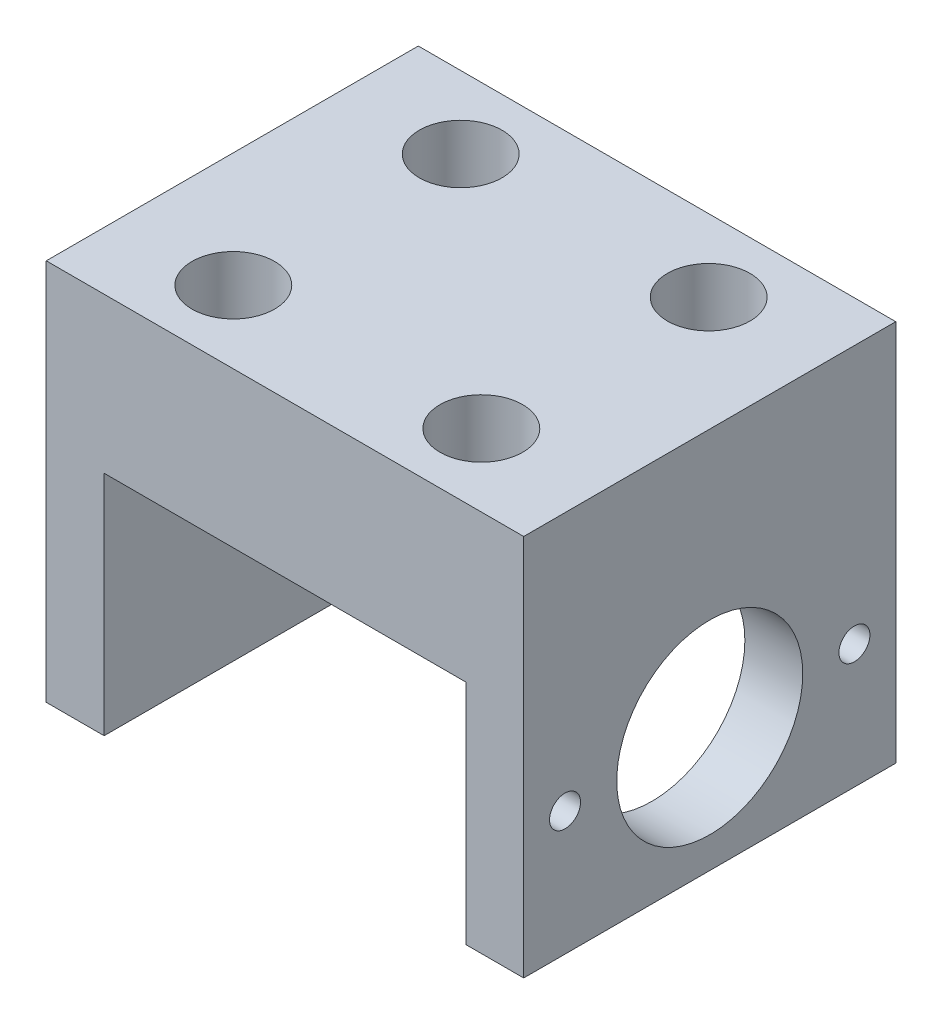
ISO-10303-21;
HEADER;
FILE_DESCRIPTION(('STEP AP214'),'2;1');
FILE_NAME('part.step','',(''),(''),'','','');
FILE_SCHEMA(('AUTOMOTIVE_DESIGN { 1 0 10303 214 1 1 1 1 }'));
ENDSEC;
DATA;
#1=APPLICATION_CONTEXT('core data for automotive mechanical design processes');
#2=APPLICATION_PROTOCOL_DEFINITION('international standard','automotive_design',2000,#1);
#3=PRODUCT_CONTEXT('',#1,'mechanical');
#4=PRODUCT('Part','Part','',(#3));
#5=PRODUCT_RELATED_PRODUCT_CATEGORY('part','',(#4));
#6=PRODUCT_DEFINITION_FORMATION('','',#4);
#7=PRODUCT_DEFINITION_CONTEXT('part definition',#1,'design');
#8=PRODUCT_DEFINITION('design','',#6,#7);
#9=PRODUCT_DEFINITION_SHAPE('','',#8);
#10=(LENGTH_UNIT() NAMED_UNIT(*) SI_UNIT(.MILLI.,.METRE.));
#11=(NAMED_UNIT(*) PLANE_ANGLE_UNIT() SI_UNIT($,.RADIAN.));
#12=(NAMED_UNIT(*) SI_UNIT($,.STERADIAN.) SOLID_ANGLE_UNIT());
#13=UNCERTAINTY_MEASURE_WITH_UNIT(LENGTH_MEASURE(1.E-05),#10,'distance_accuracy_value','');
#14=(GEOMETRIC_REPRESENTATION_CONTEXT(3) GLOBAL_UNCERTAINTY_ASSIGNED_CONTEXT((#13)) GLOBAL_UNIT_ASSIGNED_CONTEXT((#10,
#11,#12)) REPRESENTATION_CONTEXT('',''));
#15=CARTESIAN_POINT('',(0.,0.,0.));
#16=DIRECTION('',(0.,0.,1.));
#17=DIRECTION('',(1.,0.,0.));
#18=AXIS2_PLACEMENT_3D('',#15,#16,#17);
#19=CARTESIAN_POINT('',(-23.1,-37.,-18.));
#20=DIRECTION('',(0.,-1.,0.));
#21=DIRECTION('',(0.,0.,-1.));
#22=AXIS2_PLACEMENT_3D('',#19,#20,#21);
#23=PLANE('',#22);
#24=DIRECTION('',(0.,0.,-1.));
#25=VECTOR('',#24,1.);
#26=CARTESIAN_POINT('',(17.5,-37.,18.));
#27=LINE('',#26,#25);
#28=CARTESIAN_POINT('',(17.5,-37.,18.));
#29=VERTEX_POINT('',#28);
#30=CARTESIAN_POINT('',(17.5,-37.,-18.));
#31=VERTEX_POINT('',#30);
#32=EDGE_CURVE('E90',#29,#31,#27,.T.);
#33=ORIENTED_EDGE('',*,*,#32,.T.);
#34=DIRECTION('',(1.,0.,0.));
#35=VECTOR('',#34,1.);
#36=CARTESIAN_POINT('',(-23.1,-37.,-18.));
#37=LINE('',#36,#35);
#38=CARTESIAN_POINT('',(23.1,-37.,-18.));
#39=VERTEX_POINT('',#38);
#40=EDGE_CURVE('E181',#31,#39,#37,.T.);
#41=ORIENTED_EDGE('',*,*,#40,.T.);
#42=DIRECTION('',(0.,0.,1.));
#43=VECTOR('',#42,1.);
#44=CARTESIAN_POINT('',(23.1,-37.,-18.));
#45=LINE('',#44,#43);
#46=CARTESIAN_POINT('',(23.1,-37.,18.));
#47=VERTEX_POINT('',#46);
#48=EDGE_CURVE('E25',#39,#47,#45,.T.);
#49=ORIENTED_EDGE('',*,*,#48,.T.);
#50=DIRECTION('',(1.,0.,0.));
#51=VECTOR('',#50,1.);
#52=CARTESIAN_POINT('',(-23.1,-37.,18.));
#53=LINE('',#52,#51);
#54=EDGE_CURVE('E104',#29,#47,#53,.T.);
#55=ORIENTED_EDGE('',*,*,#54,.F.);
#56=EDGE_LOOP('',(#33,#41,#49,#55));
#57=FACE_BOUND('',#56,.T.);
#58=ADVANCED_FACE('F16',(#57),#23,.T.);
#59=CARTESIAN_POINT('',(23.1,0.,-18.));
#60=DIRECTION('',(0.,1.,0.));
#61=DIRECTION('',(-1.,0.,0.));
#62=AXIS2_PLACEMENT_3D('',#59,#60,#61);
#63=PLANE('',#62);
#64=CARTESIAN_POINT('',(12.,0.,11.));
#65=DIRECTION('',(0.,1.,0.));
#66=DIRECTION('',(0.,0.,1.));
#67=AXIS2_PLACEMENT_3D('',#64,#65,#66);
#68=CIRCLE('',#67,4.);
#69=CARTESIAN_POINT('',(12.,0.,15.));
#70=VERTEX_POINT('',#69);
#71=EDGE_CURVE('E148',#70,#70,#68,.T.);
#72=ORIENTED_EDGE('',*,*,#71,.F.);
#73=EDGE_LOOP('',(#72));
#74=FACE_BOUND('',#73,.T.);
#75=CARTESIAN_POINT('',(-12.,0.,11.));
#76=DIRECTION('',(0.,1.,0.));
#77=DIRECTION('',(0.,0.,1.));
#78=AXIS2_PLACEMENT_3D('',#75,#76,#77);
#79=CIRCLE('',#78,4.);
#80=CARTESIAN_POINT('',(-12.,0.,15.));
#81=VERTEX_POINT('',#80);
#82=EDGE_CURVE('E138',#81,#81,#79,.T.);
#83=ORIENTED_EDGE('',*,*,#82,.F.);
#84=EDGE_LOOP('',(#83));
#85=FACE_BOUND('',#84,.T.);
#86=CARTESIAN_POINT('',(-12.,0.,-11.));
#87=DIRECTION('',(0.,1.,0.));
#88=DIRECTION('',(0.,0.,1.));
#89=AXIS2_PLACEMENT_3D('',#86,#87,#88);
#90=CIRCLE('',#89,4.);
#91=CARTESIAN_POINT('',(-12.,0.,-7.));
#92=VERTEX_POINT('',#91);
#93=EDGE_CURVE('E135',#92,#92,#90,.T.);
#94=ORIENTED_EDGE('',*,*,#93,.F.);
#95=EDGE_LOOP('',(#94));
#96=FACE_BOUND('',#95,.T.);
#97=CARTESIAN_POINT('',(12.,0.,-11.));
#98=DIRECTION('',(0.,1.,0.));
#99=DIRECTION('',(0.,0.,1.));
#100=AXIS2_PLACEMENT_3D('',#97,#98,#99);
#101=CIRCLE('',#100,4.);
#102=CARTESIAN_POINT('',(12.,0.,-7.));
#103=VERTEX_POINT('',#102);
#104=EDGE_CURVE('E132',#103,#103,#101,.T.);
#105=ORIENTED_EDGE('',*,*,#104,.F.);
#106=EDGE_LOOP('',(#105));
#107=FACE_BOUND('',#106,.T.);
#108=DIRECTION('',(-1.,0.,0.));
#109=VECTOR('',#108,1.);
#110=CARTESIAN_POINT('',(23.1,0.,18.));
#111=LINE('',#110,#109);
#112=CARTESIAN_POINT('',(23.1,0.,18.));
#113=VERTEX_POINT('',#112);
#114=CARTESIAN_POINT('',(-23.1,0.,18.));
#115=VERTEX_POINT('',#114);
#116=EDGE_CURVE('E117',#113,#115,#111,.T.);
#117=ORIENTED_EDGE('',*,*,#116,.F.);
#118=DIRECTION('',(0.,0.,1.));
#119=VECTOR('',#118,1.);
#120=CARTESIAN_POINT('',(23.1,0.,-18.));
#121=LINE('',#120,#119);
#122=CARTESIAN_POINT('',(23.1,0.,-18.));
#123=VERTEX_POINT('',#122);
#124=EDGE_CURVE('E10',#123,#113,#121,.T.);
#125=ORIENTED_EDGE('',*,*,#124,.F.);
#126=DIRECTION('',(-1.,0.,0.));
#127=VECTOR('',#126,1.);
#128=CARTESIAN_POINT('',(23.1,0.,-18.));
#129=LINE('',#128,#127);
#130=CARTESIAN_POINT('',(-23.1,0.,-18.));
#131=VERTEX_POINT('',#130);
#132=EDGE_CURVE('E121',#123,#131,#129,.T.);
#133=ORIENTED_EDGE('',*,*,#132,.T.);
#134=DIRECTION('',(0.,0.,1.));
#135=VECTOR('',#134,1.);
#136=CARTESIAN_POINT('',(-23.1,0.,-18.));
#137=LINE('',#136,#135);
#138=EDGE_CURVE('E66',#131,#115,#137,.T.);
#139=ORIENTED_EDGE('',*,*,#138,.T.);
#140=EDGE_LOOP('',(#117,#125,#133,#139));
#141=FACE_BOUND('',#140,.T.);
#142=ADVANCED_FACE('F18',(#74,#85,#96,#107,#141),#63,.T.);
#143=CARTESIAN_POINT('',(23.1,-37.,-18.));
#144=DIRECTION('',(1.,0.,0.));
#145=DIRECTION('',(0.,1.,0.));
#146=AXIS2_PLACEMENT_3D('',#143,#144,#145);
#147=PLANE('',#146);
#148=CARTESIAN_POINT('',(23.1,-25.,0.));
#149=DIRECTION('',(1.,0.,0.));
#150=DIRECTION('',(0.,0.,-1.));
#151=AXIS2_PLACEMENT_3D('',#148,#149,#150);
#152=CIRCLE('',#151,9.);
#153=CARTESIAN_POINT('',(23.1,-25.,-9.));
#154=VERTEX_POINT('',#153);
#155=EDGE_CURVE('E272',#154,#154,#152,.T.);
#156=ORIENTED_EDGE('',*,*,#155,.F.);
#157=EDGE_LOOP('',(#156));
#158=FACE_BOUND('',#157,.T.);
#159=CARTESIAN_POINT('',(23.1,-25.,14.));
#160=DIRECTION('',(1.,0.,0.));
#161=DIRECTION('',(0.,0.,-1.));
#162=AXIS2_PLACEMENT_3D('',#159,#160,#161);
#163=CIRCLE('',#162,1.49999999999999);
#164=CARTESIAN_POINT('',(23.1,-25.,12.5));
#165=VERTEX_POINT('',#164);
#166=EDGE_CURVE('E131',#165,#165,#163,.T.);
#167=ORIENTED_EDGE('',*,*,#166,.F.);
#168=EDGE_LOOP('',(#167));
#169=FACE_BOUND('',#168,.T.);
#170=CARTESIAN_POINT('',(23.1,-25.,-14.));
#171=DIRECTION('',(1.,0.,0.));
#172=DIRECTION('',(0.,0.,-1.));
#173=AXIS2_PLACEMENT_3D('',#170,#171,#172);
#174=CIRCLE('',#173,1.49999999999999);
#175=CARTESIAN_POINT('',(23.1,-25.,-15.5));
#176=VERTEX_POINT('',#175);
#177=EDGE_CURVE('E159',#176,#176,#174,.T.);
#178=ORIENTED_EDGE('',*,*,#177,.F.);
#179=EDGE_LOOP('',(#178));
#180=FACE_BOUND('',#179,.T.);
#181=DIRECTION('',(0.,1.,0.));
#182=VECTOR('',#181,1.);
#183=CARTESIAN_POINT('',(23.1,-37.,18.));
#184=LINE('',#183,#182);
#185=EDGE_CURVE('E115',#47,#113,#184,.T.);
#186=ORIENTED_EDGE('',*,*,#185,.F.);
#187=ORIENTED_EDGE('',*,*,#48,.F.);
#188=DIRECTION('',(0.,1.,0.));
#189=VECTOR('',#188,1.);
#190=CARTESIAN_POINT('',(23.1,-37.,-18.));
#191=LINE('',#190,#189);
#192=EDGE_CURVE('E127',#39,#123,#191,.T.);
#193=ORIENTED_EDGE('',*,*,#192,.T.);
#194=ORIENTED_EDGE('',*,*,#124,.T.);
#195=EDGE_LOOP('',(#186,#187,#193,#194));
#196=FACE_BOUND('',#195,.T.);
#197=ADVANCED_FACE('F200',(#158,#169,#180,#196),#147,.T.);
#198=DIRECTION('',(0.,0.,-1.));
#199=VECTOR('',#198,1.);
#200=CARTESIAN_POINT('',(-17.5,-37.,18.));
#201=LINE('',#200,#199);
#202=CARTESIAN_POINT('',(-17.5,-37.,18.));
#203=VERTEX_POINT('',#202);
#204=CARTESIAN_POINT('',(-17.5,-37.,-18.));
#205=VERTEX_POINT('',#204);
#206=EDGE_CURVE('E99',#203,#205,#201,.T.);
#207=ORIENTED_EDGE('',*,*,#206,.F.);
#208=CARTESIAN_POINT('',(-23.1,-37.,18.));
#209=VERTEX_POINT('',#208);
#210=EDGE_CURVE('E111',#209,#203,#53,.T.);
#211=ORIENTED_EDGE('',*,*,#210,.F.);
#212=DIRECTION('',(0.,0.,1.));
#213=VECTOR('',#212,1.);
#214=CARTESIAN_POINT('',(-23.1,-37.,-18.));
#215=LINE('',#214,#213);
#216=CARTESIAN_POINT('',(-23.1,-37.,-18.));
#217=VERTEX_POINT('',#216);
#218=EDGE_CURVE('E124',#217,#209,#215,.T.);
#219=ORIENTED_EDGE('',*,*,#218,.F.);
#220=EDGE_CURVE('E182',#217,#205,#37,.T.);
#221=ORIENTED_EDGE('',*,*,#220,.T.);
#222=EDGE_LOOP('',(#207,#211,#219,#221));
#223=FACE_BOUND('',#222,.T.);
#224=ADVANCED_FACE('F191',(#223),#23,.T.);
#225=CARTESIAN_POINT('',(-23.1,0.,-18.));
#226=DIRECTION('',(-1.,0.,0.));
#227=DIRECTION('',(0.,-1.,0.));
#228=AXIS2_PLACEMENT_3D('',#225,#226,#227);
#229=PLANE('',#228);
#230=DIRECTION('',(0.,-1.,0.));
#231=VECTOR('',#230,1.);
#232=CARTESIAN_POINT('',(-23.1,0.,18.));
#233=LINE('',#232,#231);
#234=EDGE_CURVE('E112',#115,#209,#233,.T.);
#235=ORIENTED_EDGE('',*,*,#234,.F.);
#236=ORIENTED_EDGE('',*,*,#138,.F.);
#237=DIRECTION('',(0.,-1.,0.));
#238=VECTOR('',#237,1.);
#239=CARTESIAN_POINT('',(-23.1,0.,-18.));
#240=LINE('',#239,#238);
#241=EDGE_CURVE('E179',#131,#217,#240,.T.);
#242=ORIENTED_EDGE('',*,*,#241,.T.);
#243=ORIENTED_EDGE('',*,*,#218,.T.);
#244=EDGE_LOOP('',(#235,#236,#242,#243));
#245=FACE_BOUND('',#244,.T.);
#246=ADVANCED_FACE('F186',(#245),#229,.T.);
#247=CARTESIAN_POINT('',(0.,0.,-18.));
#248=DIRECTION('',(0.,0.,1.));
#249=DIRECTION('',(1.,0.,0.));
#250=AXIS2_PLACEMENT_3D('',#247,#248,#249);
#251=PLANE('',#250);
#252=ORIENTED_EDGE('',*,*,#40,.F.);
#253=DIRECTION('',(0.,-1.,0.));
#254=VECTOR('',#253,1.);
#255=CARTESIAN_POINT('',(17.5,-15.,-18.));
#256=LINE('',#255,#254);
#257=CARTESIAN_POINT('',(17.5,-15.,-18.));
#258=VERTEX_POINT('',#257);
#259=EDGE_CURVE('E95',#258,#31,#256,.T.);
#260=ORIENTED_EDGE('',*,*,#259,.F.);
#261=DIRECTION('',(1.,0.,0.));
#262=VECTOR('',#261,1.);
#263=CARTESIAN_POINT('',(-17.5,-15.,-18.));
#264=LINE('',#263,#262);
#265=CARTESIAN_POINT('',(-17.5,-15.,-18.));
#266=VERTEX_POINT('',#265);
#267=EDGE_CURVE('E108',#266,#258,#264,.T.);
#268=ORIENTED_EDGE('',*,*,#267,.F.);
#269=DIRECTION('',(0.,1.,0.));
#270=VECTOR('',#269,1.);
#271=CARTESIAN_POINT('',(-17.5,-37.,-18.));
#272=LINE('',#271,#270);
#273=EDGE_CURVE('E168',#205,#266,#272,.T.);
#274=ORIENTED_EDGE('',*,*,#273,.F.);
#275=ORIENTED_EDGE('',*,*,#220,.F.);
#276=ORIENTED_EDGE('',*,*,#241,.F.);
#277=ORIENTED_EDGE('',*,*,#132,.F.);
#278=ORIENTED_EDGE('',*,*,#192,.F.);
#279=EDGE_LOOP('',(#252,#260,#268,#274,#275,#276,#277,#278));
#280=FACE_BOUND('',#279,.T.);
#281=ADVANCED_FACE('F198',(#280),#251,.F.);
#282=CARTESIAN_POINT('',(0.,0.,18.));
#283=DIRECTION('',(0.,0.,1.));
#284=DIRECTION('',(1.,0.,0.));
#285=AXIS2_PLACEMENT_3D('',#282,#283,#284);
#286=PLANE('',#285);
#287=DIRECTION('',(0.,-1.,0.));
#288=VECTOR('',#287,1.);
#289=CARTESIAN_POINT('',(17.5,-15.,18.));
#290=LINE('',#289,#288);
#291=CARTESIAN_POINT('',(17.5,-15.,18.));
#292=VERTEX_POINT('',#291);
#293=EDGE_CURVE('E93',#292,#29,#290,.T.);
#294=ORIENTED_EDGE('',*,*,#293,.T.);
#295=ORIENTED_EDGE('',*,*,#54,.T.);
#296=ORIENTED_EDGE('',*,*,#185,.T.);
#297=ORIENTED_EDGE('',*,*,#116,.T.);
#298=ORIENTED_EDGE('',*,*,#234,.T.);
#299=ORIENTED_EDGE('',*,*,#210,.T.);
#300=DIRECTION('',(0.,1.,0.));
#301=VECTOR('',#300,1.);
#302=CARTESIAN_POINT('',(-17.5,-37.,18.));
#303=LINE('',#302,#301);
#304=CARTESIAN_POINT('',(-17.5,-15.,18.));
#305=VERTEX_POINT('',#304);
#306=EDGE_CURVE('E107',#203,#305,#303,.T.);
#307=ORIENTED_EDGE('',*,*,#306,.T.);
#308=DIRECTION('',(1.,0.,0.));
#309=VECTOR('',#308,1.);
#310=CARTESIAN_POINT('',(-17.5,-15.,18.));
#311=LINE('',#310,#309);
#312=EDGE_CURVE('E33',#305,#292,#311,.T.);
#313=ORIENTED_EDGE('',*,*,#312,.T.);
#314=EDGE_LOOP('',(#294,#295,#296,#297,#298,#299,#307,#313));
#315=FACE_BOUND('',#314,.T.);
#316=ADVANCED_FACE('F102',(#315),#286,.T.);
#317=CARTESIAN_POINT('',(17.5,-15.,18.));
#318=DIRECTION('',(1.,0.,0.));
#319=DIRECTION('',(0.,0.,-1.));
#320=AXIS2_PLACEMENT_3D('',#317,#318,#319);
#321=PLANE('',#320);
#322=CARTESIAN_POINT('',(17.5,-25.,0.));
#323=DIRECTION('',(1.,0.,0.));
#324=DIRECTION('',(0.,0.,-1.));
#325=AXIS2_PLACEMENT_3D('',#322,#323,#324);
#326=CIRCLE('',#325,9.);
#327=CARTESIAN_POINT('',(17.5,-25.,-9.));
#328=VERTEX_POINT('',#327);
#329=EDGE_CURVE('E270',#328,#328,#326,.T.);
#330=ORIENTED_EDGE('',*,*,#329,.T.);
#331=EDGE_LOOP('',(#330));
#332=FACE_BOUND('',#331,.T.);
#333=CARTESIAN_POINT('',(17.5,-25.,14.));
#334=DIRECTION('',(1.,0.,0.));
#335=DIRECTION('',(0.,0.,-1.));
#336=AXIS2_PLACEMENT_3D('',#333,#334,#335);
#337=CIRCLE('',#336,1.5);
#338=CARTESIAN_POINT('',(17.5,-25.,12.5));
#339=VERTEX_POINT('',#338);
#340=EDGE_CURVE('E156',#339,#339,#337,.T.);
#341=ORIENTED_EDGE('',*,*,#340,.T.);
#342=EDGE_LOOP('',(#341));
#343=FACE_BOUND('',#342,.T.);
#344=CARTESIAN_POINT('',(17.5,-25.,-14.));
#345=DIRECTION('',(1.,0.,0.));
#346=DIRECTION('',(0.,0.,-1.));
#347=AXIS2_PLACEMENT_3D('',#344,#345,#346);
#348=CIRCLE('',#347,1.5);
#349=CARTESIAN_POINT('',(17.5,-25.,-15.5));
#350=VERTEX_POINT('',#349);
#351=EDGE_CURVE('E162',#350,#350,#348,.T.);
#352=ORIENTED_EDGE('',*,*,#351,.T.);
#353=EDGE_LOOP('',(#352));
#354=FACE_BOUND('',#353,.T.);
#355=ORIENTED_EDGE('',*,*,#259,.T.);
#356=ORIENTED_EDGE('',*,*,#32,.F.);
#357=ORIENTED_EDGE('',*,*,#293,.F.);
#358=DIRECTION('',(0.,0.,-1.));
#359=VECTOR('',#358,1.);
#360=CARTESIAN_POINT('',(17.5,-15.,18.));
#361=LINE('',#360,#359);
#362=EDGE_CURVE('E173',#292,#258,#361,.T.);
#363=ORIENTED_EDGE('',*,*,#362,.T.);
#364=EDGE_LOOP('',(#355,#356,#357,#363));
#365=FACE_BOUND('',#364,.T.);
#366=ADVANCED_FACE('F92',(#332,#343,#354,#365),#321,.F.);
#367=CARTESIAN_POINT('',(-17.5,-15.,18.));
#368=DIRECTION('',(0.,1.,0.));
#369=DIRECTION('',(0.,0.,1.));
#370=AXIS2_PLACEMENT_3D('',#367,#368,#369);
#371=PLANE('',#370);
#372=CARTESIAN_POINT('',(12.,-15.,11.));
#373=DIRECTION('',(0.,1.,0.));
#374=DIRECTION('',(0.,0.,1.));
#375=AXIS2_PLACEMENT_3D('',#372,#373,#374);
#376=CIRCLE('',#375,4.);
#377=CARTESIAN_POINT('',(12.,-15.,15.));
#378=VERTEX_POINT('',#377);
#379=EDGE_CURVE('E20',#378,#378,#376,.T.);
#380=ORIENTED_EDGE('',*,*,#379,.T.);
#381=EDGE_LOOP('',(#380));
#382=FACE_BOUND('',#381,.T.);
#383=CARTESIAN_POINT('',(-12.,-15.,11.));
#384=DIRECTION('',(0.,1.,0.));
#385=DIRECTION('',(0.,0.,1.));
#386=AXIS2_PLACEMENT_3D('',#383,#384,#385);
#387=CIRCLE('',#386,4.);
#388=CARTESIAN_POINT('',(-12.,-15.,15.));
#389=VERTEX_POINT('',#388);
#390=EDGE_CURVE('E136',#389,#389,#387,.T.);
#391=ORIENTED_EDGE('',*,*,#390,.T.);
#392=EDGE_LOOP('',(#391));
#393=FACE_BOUND('',#392,.T.);
#394=CARTESIAN_POINT('',(-12.,-15.,-11.));
#395=DIRECTION('',(0.,1.,0.));
#396=DIRECTION('',(0.,0.,1.));
#397=AXIS2_PLACEMENT_3D('',#394,#395,#396);
#398=CIRCLE('',#397,4.);
#399=CARTESIAN_POINT('',(-12.,-15.,-7.));
#400=VERTEX_POINT('',#399);
#401=EDGE_CURVE('E133',#400,#400,#398,.T.);
#402=ORIENTED_EDGE('',*,*,#401,.T.);
#403=EDGE_LOOP('',(#402));
#404=FACE_BOUND('',#403,.T.);
#405=CARTESIAN_POINT('',(12.,-15.,-11.));
#406=DIRECTION('',(0.,1.,0.));
#407=DIRECTION('',(0.,0.,1.));
#408=AXIS2_PLACEMENT_3D('',#405,#406,#407);
#409=CIRCLE('',#408,4.);
#410=CARTESIAN_POINT('',(12.,-15.,-7.));
#411=VERTEX_POINT('',#410);
#412=EDGE_CURVE('E128',#411,#411,#409,.T.);
#413=ORIENTED_EDGE('',*,*,#412,.T.);
#414=EDGE_LOOP('',(#413));
#415=FACE_BOUND('',#414,.T.);
#416=ORIENTED_EDGE('',*,*,#267,.T.);
#417=ORIENTED_EDGE('',*,*,#362,.F.);
#418=ORIENTED_EDGE('',*,*,#312,.F.);
#419=DIRECTION('',(0.,0.,-1.));
#420=VECTOR('',#419,1.);
#421=CARTESIAN_POINT('',(-17.5,-15.,18.));
#422=LINE('',#421,#420);
#423=EDGE_CURVE('E175',#305,#266,#422,.T.);
#424=ORIENTED_EDGE('',*,*,#423,.T.);
#425=EDGE_LOOP('',(#416,#417,#418,#424));
#426=FACE_BOUND('',#425,.T.);
#427=ADVANCED_FACE('F196',(#382,#393,#404,#415,#426),#371,.F.);
#428=CARTESIAN_POINT('',(-17.5,-37.,18.));
#429=DIRECTION('',(-1.,0.,0.));
#430=DIRECTION('',(0.,0.,1.));
#431=AXIS2_PLACEMENT_3D('',#428,#429,#430);
#432=PLANE('',#431);
#433=ORIENTED_EDGE('',*,*,#273,.T.);
#434=ORIENTED_EDGE('',*,*,#423,.F.);
#435=ORIENTED_EDGE('',*,*,#306,.F.);
#436=ORIENTED_EDGE('',*,*,#206,.T.);
#437=EDGE_LOOP('',(#433,#434,#435,#436));
#438=FACE_BOUND('',#437,.T.);
#439=ADVANCED_FACE('F193',(#438),#432,.F.);
#440=CARTESIAN_POINT('',(23.1,-25.,-14.));
#441=DIRECTION('',(1.,0.,0.));
#442=DIRECTION('',(0.,0.,-1.));
#443=AXIS2_PLACEMENT_3D('',#440,#441,#442);
#444=CYLINDRICAL_SURFACE('',#443,1.5);
#445=ORIENTED_EDGE('',*,*,#351,.F.);
#446=EDGE_LOOP('',(#445));
#447=FACE_BOUND('',#446,.T.);
#448=ORIENTED_EDGE('',*,*,#177,.T.);
#449=EDGE_LOOP('',(#448));
#450=FACE_BOUND('',#449,.T.);
#451=ADVANCED_FACE('F235',(#447,#450),#444,.F.);
#452=CARTESIAN_POINT('',(23.1,-25.,14.));
#453=DIRECTION('',(1.,0.,0.));
#454=DIRECTION('',(0.,0.,-1.));
#455=AXIS2_PLACEMENT_3D('',#452,#453,#454);
#456=CYLINDRICAL_SURFACE('',#455,1.5);
#457=ORIENTED_EDGE('',*,*,#340,.F.);
#458=EDGE_LOOP('',(#457));
#459=FACE_BOUND('',#458,.T.);
#460=ORIENTED_EDGE('',*,*,#166,.T.);
#461=EDGE_LOOP('',(#460));
#462=FACE_BOUND('',#461,.T.);
#463=ADVANCED_FACE('F241',(#459,#462),#456,.F.);
#464=CARTESIAN_POINT('',(12.,0.,-11.));
#465=DIRECTION('',(0.,1.,0.));
#466=DIRECTION('',(0.,0.,1.));
#467=AXIS2_PLACEMENT_3D('',#464,#465,#466);
#468=CYLINDRICAL_SURFACE('',#467,4.);
#469=ORIENTED_EDGE('',*,*,#104,.T.);
#470=EDGE_LOOP('',(#469));
#471=FACE_BOUND('',#470,.T.);
#472=ORIENTED_EDGE('',*,*,#412,.F.);
#473=EDGE_LOOP('',(#472));
#474=FACE_BOUND('',#473,.T.);
#475=ADVANCED_FACE('F245',(#471,#474),#468,.F.);
#476=CARTESIAN_POINT('',(-12.,0.,-11.));
#477=DIRECTION('',(0.,1.,0.));
#478=DIRECTION('',(0.,0.,1.));
#479=AXIS2_PLACEMENT_3D('',#476,#477,#478);
#480=CYLINDRICAL_SURFACE('',#479,4.);
#481=ORIENTED_EDGE('',*,*,#93,.T.);
#482=EDGE_LOOP('',(#481));
#483=FACE_BOUND('',#482,.T.);
#484=ORIENTED_EDGE('',*,*,#401,.F.);
#485=EDGE_LOOP('',(#484));
#486=FACE_BOUND('',#485,.T.);
#487=ADVANCED_FACE('F249',(#483,#486),#480,.F.);
#488=CARTESIAN_POINT('',(-12.,0.,11.));
#489=DIRECTION('',(0.,1.,0.));
#490=DIRECTION('',(0.,0.,1.));
#491=AXIS2_PLACEMENT_3D('',#488,#489,#490);
#492=CYLINDRICAL_SURFACE('',#491,4.);
#493=ORIENTED_EDGE('',*,*,#82,.T.);
#494=EDGE_LOOP('',(#493));
#495=FACE_BOUND('',#494,.T.);
#496=ORIENTED_EDGE('',*,*,#390,.F.);
#497=EDGE_LOOP('',(#496));
#498=FACE_BOUND('',#497,.T.);
#499=ADVANCED_FACE('F253',(#495,#498),#492,.F.);
#500=CARTESIAN_POINT('',(12.,0.,11.));
#501=DIRECTION('',(0.,1.,0.));
#502=DIRECTION('',(0.,0.,1.));
#503=AXIS2_PLACEMENT_3D('',#500,#501,#502);
#504=CYLINDRICAL_SURFACE('',#503,4.);
#505=ORIENTED_EDGE('',*,*,#71,.T.);
#506=EDGE_LOOP('',(#505));
#507=FACE_BOUND('',#506,.T.);
#508=ORIENTED_EDGE('',*,*,#379,.F.);
#509=EDGE_LOOP('',(#508));
#510=FACE_BOUND('',#509,.T.);
#511=ADVANCED_FACE('F257',(#507,#510),#504,.F.);
#512=CARTESIAN_POINT('',(23.1,-25.,0.));
#513=DIRECTION('',(1.,0.,0.));
#514=DIRECTION('',(0.,0.,-1.));
#515=AXIS2_PLACEMENT_3D('',#512,#513,#514);
#516=CYLINDRICAL_SURFACE('',#515,9.);
#517=ORIENTED_EDGE('',*,*,#329,.F.);
#518=EDGE_LOOP('',(#517));
#519=FACE_BOUND('',#518,.T.);
#520=ORIENTED_EDGE('',*,*,#155,.T.);
#521=EDGE_LOOP('',(#520));
#522=FACE_BOUND('',#521,.T.);
#523=ADVANCED_FACE('F260',(#519,#522),#516,.F.);
#524=CLOSED_SHELL('',(#58,#142,#197,#224,#246,#281,#316,#366,#427,#439,#451,#463,#475,#487,#499,
#511,#523));
#525=MANIFOLD_SOLID_BREP('B1',#524);
#526=ADVANCED_BREP_SHAPE_REPRESENTATION('',(#18,#525),#14);
#527=SHAPE_DEFINITION_REPRESENTATION(#9,#526);
ENDSEC;
END-ISO-10303-21;
